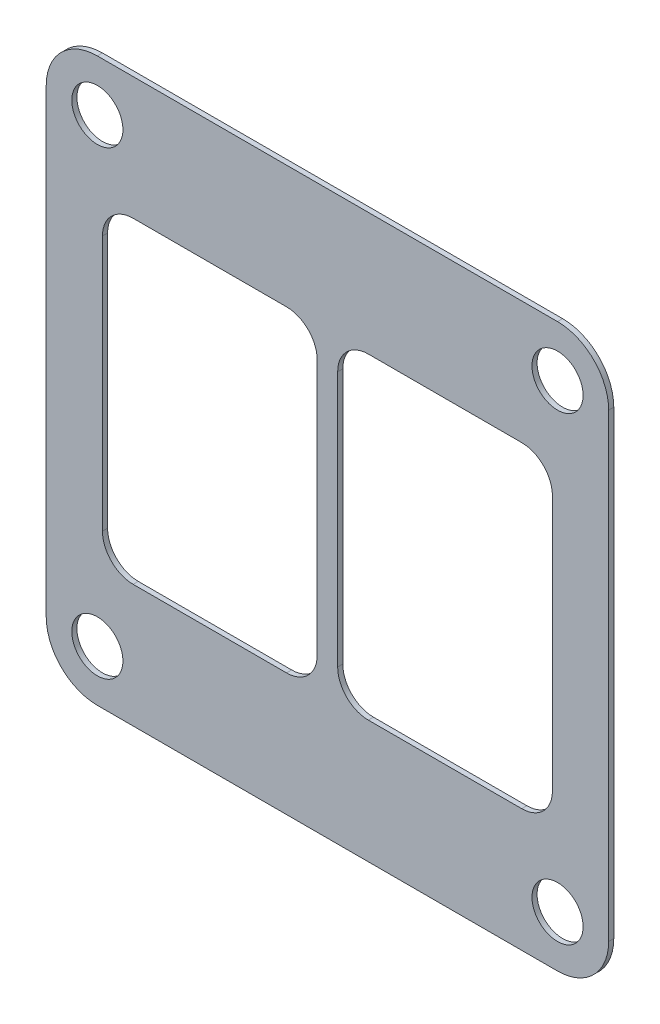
ISO-10303-21;
HEADER;
FILE_DESCRIPTION(('STEP AP214'),'2;1');
FILE_NAME('part.step','',(''),(''),'','','');
FILE_SCHEMA(('AUTOMOTIVE_DESIGN { 1 0 10303 214 1 1 1 1 }'));
ENDSEC;
DATA;
#1=APPLICATION_CONTEXT('core data for automotive mechanical design processes');
#2=APPLICATION_PROTOCOL_DEFINITION('international standard','automotive_design',2000,#1);
#3=PRODUCT_CONTEXT('',#1,'mechanical');
#4=PRODUCT('Part','Part','',(#3));
#5=PRODUCT_RELATED_PRODUCT_CATEGORY('part','',(#4));
#6=PRODUCT_DEFINITION_FORMATION('','',#4);
#7=PRODUCT_DEFINITION_CONTEXT('part definition',#1,'design');
#8=PRODUCT_DEFINITION('design','',#6,#7);
#9=PRODUCT_DEFINITION_SHAPE('','',#8);
#10=(LENGTH_UNIT() NAMED_UNIT(*) SI_UNIT(.MILLI.,.METRE.));
#11=(NAMED_UNIT(*) PLANE_ANGLE_UNIT() SI_UNIT($,.RADIAN.));
#12=(NAMED_UNIT(*) SI_UNIT($,.STERADIAN.) SOLID_ANGLE_UNIT());
#13=UNCERTAINTY_MEASURE_WITH_UNIT(LENGTH_MEASURE(1.E-05),#10,'distance_accuracy_value','');
#14=(GEOMETRIC_REPRESENTATION_CONTEXT(3) GLOBAL_UNCERTAINTY_ASSIGNED_CONTEXT((#13)) GLOBAL_UNIT_ASSIGNED_CONTEXT((#10,
#11,#12)) REPRESENTATION_CONTEXT('',''));
#15=CARTESIAN_POINT('',(0.,0.,0.));
#16=DIRECTION('',(0.,0.,1.));
#17=DIRECTION('',(1.,0.,0.));
#18=AXIS2_PLACEMENT_3D('',#15,#16,#17);
#19=CARTESIAN_POINT('',(-27.5,-27.5,0.5));
#20=DIRECTION('',(0.,0.,1.));
#21=DIRECTION('',(1.,0.,0.));
#22=AXIS2_PLACEMENT_3D('',#19,#20,#21);
#23=PLANE('',#22);
#24=DIRECTION('',(-1.,0.,0.));
#25=VECTOR('',#24,1.);
#26=CARTESIAN_POINT('',(-27.5,27.5,0.5));
#27=LINE('',#26,#25);
#28=CARTESIAN_POINT('',(22.5,27.5,0.5));
#29=VERTEX_POINT('',#28);
#30=CARTESIAN_POINT('',(-22.5,27.5,0.5));
#31=VERTEX_POINT('',#30);
#32=EDGE_CURVE('E239',#29,#31,#27,.T.);
#33=ORIENTED_EDGE('',*,*,#32,.T.);
#34=CARTESIAN_POINT('',(-22.5,22.5,0.5));
#35=DIRECTION('',(0.,0.,1.));
#36=DIRECTION('',(1.,0.,0.));
#37=AXIS2_PLACEMENT_3D('',#34,#35,#36);
#38=CIRCLE('',#37,5.);
#39=CARTESIAN_POINT('',(-27.5,22.5,0.5));
#40=VERTEX_POINT('',#39);
#41=EDGE_CURVE('E256',#31,#40,#38,.T.);
#42=ORIENTED_EDGE('',*,*,#41,.T.);
#43=DIRECTION('',(0.,-1.,0.));
#44=VECTOR('',#43,1.);
#45=CARTESIAN_POINT('',(-27.5,27.5,0.5));
#46=LINE('',#45,#44);
#47=CARTESIAN_POINT('',(-27.5,-22.5,0.5));
#48=VERTEX_POINT('',#47);
#49=EDGE_CURVE('E210',#40,#48,#46,.T.);
#50=ORIENTED_EDGE('',*,*,#49,.T.);
#51=CARTESIAN_POINT('',(-22.5,-22.5,0.5));
#52=DIRECTION('',(0.,0.,1.));
#53=DIRECTION('',(1.,0.,0.));
#54=AXIS2_PLACEMENT_3D('',#51,#52,#53);
#55=CIRCLE('',#54,5.);
#56=CARTESIAN_POINT('',(-22.5,-27.5,0.5));
#57=VERTEX_POINT('',#56);
#58=EDGE_CURVE('E250',#48,#57,#55,.T.);
#59=ORIENTED_EDGE('',*,*,#58,.T.);
#60=DIRECTION('',(1.,0.,0.));
#61=VECTOR('',#60,1.);
#62=CARTESIAN_POINT('',(-27.5,-27.5,0.5));
#63=LINE('',#62,#61);
#64=CARTESIAN_POINT('',(22.5,-27.5,0.5));
#65=VERTEX_POINT('',#64);
#66=EDGE_CURVE('E233',#57,#65,#63,.T.);
#67=ORIENTED_EDGE('',*,*,#66,.T.);
#68=CARTESIAN_POINT('',(22.5,-22.5,0.5));
#69=DIRECTION('',(0.,0.,1.));
#70=DIRECTION('',(1.,0.,0.));
#71=AXIS2_PLACEMENT_3D('',#68,#69,#70);
#72=CIRCLE('',#71,5.);
#73=CARTESIAN_POINT('',(27.5,-22.5,0.5));
#74=VERTEX_POINT('',#73);
#75=EDGE_CURVE('E252',#65,#74,#72,.T.);
#76=ORIENTED_EDGE('',*,*,#75,.T.);
#77=DIRECTION('',(0.,1.,0.));
#78=VECTOR('',#77,1.);
#79=CARTESIAN_POINT('',(27.5,27.5,0.5));
#80=LINE('',#79,#78);
#81=CARTESIAN_POINT('',(27.5,22.5,0.5));
#82=VERTEX_POINT('',#81);
#83=EDGE_CURVE('E236',#74,#82,#80,.T.);
#84=ORIENTED_EDGE('',*,*,#83,.T.);
#85=CARTESIAN_POINT('',(22.5,22.5,0.5));
#86=DIRECTION('',(0.,0.,1.));
#87=DIRECTION('',(1.,0.,0.));
#88=AXIS2_PLACEMENT_3D('',#85,#86,#87);
#89=CIRCLE('',#88,5.);
#90=EDGE_CURVE('E254',#82,#29,#89,.T.);
#91=ORIENTED_EDGE('',*,*,#90,.T.);
#92=EDGE_LOOP('',(#33,#42,#50,#59,#67,#76,#84,#91));
#93=FACE_BOUND('',#92,.T.);
#94=CARTESIAN_POINT('',(-22.5,22.5,0.5));
#95=DIRECTION('',(0.,0.,1.));
#96=DIRECTION('',(1.,0.,0.));
#97=AXIS2_PLACEMENT_3D('',#94,#95,#96);
#98=CIRCLE('',#97,2.5);
#99=CARTESIAN_POINT('',(-20.,22.5,0.5));
#100=VERTEX_POINT('',#99);
#101=EDGE_CURVE('E224',#100,#100,#98,.T.);
#102=ORIENTED_EDGE('',*,*,#101,.F.);
#103=EDGE_LOOP('',(#102));
#104=FACE_BOUND('',#103,.T.);
#105=CARTESIAN_POINT('',(22.5,22.5,0.5));
#106=DIRECTION('',(0.,0.,1.));
#107=DIRECTION('',(-1.,0.,0.));
#108=AXIS2_PLACEMENT_3D('',#105,#106,#107);
#109=CIRCLE('',#108,2.5);
#110=CARTESIAN_POINT('',(20.,22.5,0.5));
#111=VERTEX_POINT('',#110);
#112=EDGE_CURVE('E402',#111,#111,#109,.T.);
#113=ORIENTED_EDGE('',*,*,#112,.F.);
#114=EDGE_LOOP('',(#113));
#115=FACE_BOUND('',#114,.T.);
#116=CARTESIAN_POINT('',(22.5,-22.5,0.5));
#117=DIRECTION('',(0.,0.,1.));
#118=DIRECTION('',(1.,0.,0.));
#119=AXIS2_PLACEMENT_3D('',#116,#117,#118);
#120=CIRCLE('',#119,2.5);
#121=CARTESIAN_POINT('',(25.,-22.5,0.5));
#122=VERTEX_POINT('',#121);
#123=EDGE_CURVE('E396',#122,#122,#120,.T.);
#124=ORIENTED_EDGE('',*,*,#123,.F.);
#125=EDGE_LOOP('',(#124));
#126=FACE_BOUND('',#125,.T.);
#127=CARTESIAN_POINT('',(-22.5,-22.5,0.5));
#128=DIRECTION('',(0.,0.,1.));
#129=DIRECTION('',(-1.,0.,0.));
#130=AXIS2_PLACEMENT_3D('',#127,#128,#129);
#131=CIRCLE('',#130,2.5);
#132=CARTESIAN_POINT('',(-25.,-22.5,0.5));
#133=VERTEX_POINT('',#132);
#134=EDGE_CURVE('E390',#133,#133,#131,.T.);
#135=ORIENTED_EDGE('',*,*,#134,.F.);
#136=EDGE_LOOP('',(#135));
#137=FACE_BOUND('',#136,.T.);
#138=DIRECTION('',(0.,-1.,0.));
#139=VECTOR('',#138,1.);
#140=CARTESIAN_POINT('',(0.999999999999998,15.5,0.5));
#141=LINE('',#140,#139);
#142=CARTESIAN_POINT('',(0.999999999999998,12.5,0.5));
#143=VERTEX_POINT('',#142);
#144=CARTESIAN_POINT('',(1.,-12.5,0.5));
#145=VERTEX_POINT('',#144);
#146=EDGE_CURVE('E366',#143,#145,#141,.T.);
#147=ORIENTED_EDGE('',*,*,#146,.F.);
#148=CARTESIAN_POINT('',(4.,12.5,0.5));
#149=DIRECTION('',(0.,0.,1.));
#150=DIRECTION('',(1.,0.,0.));
#151=AXIS2_PLACEMENT_3D('',#148,#149,#150);
#152=CIRCLE('',#151,3.);
#153=CARTESIAN_POINT('',(4.,15.5,0.5));
#154=VERTEX_POINT('',#153);
#155=EDGE_CURVE('E288',#143,#154,#152,.F.);
#156=ORIENTED_EDGE('',*,*,#155,.T.);
#157=DIRECTION('',(-1.,0.,0.));
#158=VECTOR('',#157,1.);
#159=CARTESIAN_POINT('',(0.999999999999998,15.5,0.5));
#160=LINE('',#159,#158);
#161=CARTESIAN_POINT('',(19.,15.5,0.5));
#162=VERTEX_POINT('',#161);
#163=EDGE_CURVE('E375',#162,#154,#160,.T.);
#164=ORIENTED_EDGE('',*,*,#163,.F.);
#165=CARTESIAN_POINT('',(19.,12.5,0.5));
#166=DIRECTION('',(0.,0.,1.));
#167=DIRECTION('',(1.,0.,0.));
#168=AXIS2_PLACEMENT_3D('',#165,#166,#167);
#169=CIRCLE('',#168,3.);
#170=CARTESIAN_POINT('',(22.,12.5,0.5));
#171=VERTEX_POINT('',#170);
#172=EDGE_CURVE('E292',#162,#171,#169,.F.);
#173=ORIENTED_EDGE('',*,*,#172,.T.);
#174=DIRECTION('',(0.,1.,0.));
#175=VECTOR('',#174,1.);
#176=CARTESIAN_POINT('',(22.,15.5,0.5));
#177=LINE('',#176,#175);
#178=CARTESIAN_POINT('',(22.,-12.5,0.5));
#179=VERTEX_POINT('',#178);
#180=EDGE_CURVE('E372',#179,#171,#177,.T.);
#181=ORIENTED_EDGE('',*,*,#180,.F.);
#182=CARTESIAN_POINT('',(19.,-12.5,0.5));
#183=DIRECTION('',(0.,0.,1.));
#184=DIRECTION('',(1.,0.,0.));
#185=AXIS2_PLACEMENT_3D('',#182,#183,#184);
#186=CIRCLE('',#185,3.);
#187=CARTESIAN_POINT('',(19.,-15.5,0.5));
#188=VERTEX_POINT('',#187);
#189=EDGE_CURVE('E296',#179,#188,#186,.F.);
#190=ORIENTED_EDGE('',*,*,#189,.T.);
#191=DIRECTION('',(1.,0.,0.));
#192=VECTOR('',#191,1.);
#193=CARTESIAN_POINT('',(1.,-15.5,0.5));
#194=LINE('',#193,#192);
#195=CARTESIAN_POINT('',(4.,-15.5,0.5));
#196=VERTEX_POINT('',#195);
#197=EDGE_CURVE('E369',#196,#188,#194,.T.);
#198=ORIENTED_EDGE('',*,*,#197,.F.);
#199=CARTESIAN_POINT('',(4.,-12.5,0.5));
#200=DIRECTION('',(0.,0.,1.));
#201=DIRECTION('',(1.,0.,0.));
#202=AXIS2_PLACEMENT_3D('',#199,#200,#201);
#203=CIRCLE('',#202,3.);
#204=EDGE_CURVE('E300',#196,#145,#203,.F.);
#205=ORIENTED_EDGE('',*,*,#204,.T.);
#206=EDGE_LOOP('',(#147,#156,#164,#173,#181,#190,#198,#205));
#207=FACE_BOUND('',#206,.T.);
#208=DIRECTION('',(0.,1.,0.));
#209=VECTOR('',#208,1.);
#210=CARTESIAN_POINT('',(-22.,15.5,0.5));
#211=LINE('',#210,#209);
#212=CARTESIAN_POINT('',(-22.,-12.5,0.5));
#213=VERTEX_POINT('',#212);
#214=CARTESIAN_POINT('',(-22.,12.5,0.5));
#215=VERTEX_POINT('',#214);
#216=EDGE_CURVE('E345',#213,#215,#211,.T.);
#217=ORIENTED_EDGE('',*,*,#216,.T.);
#218=CARTESIAN_POINT('',(-19.,12.5,0.5));
#219=DIRECTION('',(0.,0.,1.));
#220=DIRECTION('',(1.,0.,0.));
#221=AXIS2_PLACEMENT_3D('',#218,#219,#220);
#222=CIRCLE('',#221,3.);
#223=CARTESIAN_POINT('',(-19.,15.5,0.5));
#224=VERTEX_POINT('',#223);
#225=EDGE_CURVE('E327',#215,#224,#222,.F.);
#226=ORIENTED_EDGE('',*,*,#225,.T.);
#227=DIRECTION('',(1.,0.,0.));
#228=VECTOR('',#227,1.);
#229=CARTESIAN_POINT('',(-0.999999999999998,15.5,0.5));
#230=LINE('',#229,#228);
#231=CARTESIAN_POINT('',(-4.,15.5,0.5));
#232=VERTEX_POINT('',#231);
#233=EDGE_CURVE('E737',#224,#232,#230,.T.);
#234=ORIENTED_EDGE('',*,*,#233,.T.);
#235=CARTESIAN_POINT('',(-4.,12.5,0.5));
#236=DIRECTION('',(0.,0.,1.));
#237=DIRECTION('',(1.,0.,0.));
#238=AXIS2_PLACEMENT_3D('',#235,#236,#237);
#239=CIRCLE('',#238,3.);
#240=CARTESIAN_POINT('',(-0.999999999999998,12.5,0.5));
#241=VERTEX_POINT('',#240);
#242=EDGE_CURVE('E323',#232,#241,#239,.F.);
#243=ORIENTED_EDGE('',*,*,#242,.T.);
#244=DIRECTION('',(0.,-1.,0.));
#245=VECTOR('',#244,1.);
#246=CARTESIAN_POINT('',(-0.999999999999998,15.5,0.5));
#247=LINE('',#246,#245);
#248=CARTESIAN_POINT('',(-1.,-12.5,0.5));
#249=VERTEX_POINT('',#248);
#250=EDGE_CURVE('E339',#241,#249,#247,.T.);
#251=ORIENTED_EDGE('',*,*,#250,.T.);
#252=CARTESIAN_POINT('',(-4.,-12.5,0.5));
#253=DIRECTION('',(0.,0.,1.));
#254=DIRECTION('',(1.,0.,0.));
#255=AXIS2_PLACEMENT_3D('',#252,#253,#254);
#256=CIRCLE('',#255,3.);
#257=CARTESIAN_POINT('',(-4.,-15.5,0.5));
#258=VERTEX_POINT('',#257);
#259=EDGE_CURVE('E37',#249,#258,#256,.F.);
#260=ORIENTED_EDGE('',*,*,#259,.T.);
#261=DIRECTION('',(-1.,0.,0.));
#262=VECTOR('',#261,1.);
#263=CARTESIAN_POINT('',(-1.,-15.5,0.5));
#264=LINE('',#263,#262);
#265=CARTESIAN_POINT('',(-19.,-15.5,0.5));
#266=VERTEX_POINT('',#265);
#267=EDGE_CURVE('E337',#258,#266,#264,.T.);
#268=ORIENTED_EDGE('',*,*,#267,.T.);
#269=CARTESIAN_POINT('',(-19.,-12.5,0.5));
#270=DIRECTION('',(0.,0.,1.));
#271=DIRECTION('',(1.,0.,0.));
#272=AXIS2_PLACEMENT_3D('',#269,#270,#271);
#273=CIRCLE('',#272,3.);
#274=EDGE_CURVE('E331',#266,#213,#273,.F.);
#275=ORIENTED_EDGE('',*,*,#274,.T.);
#276=EDGE_LOOP('',(#217,#226,#234,#243,#251,#260,#268,#275));
#277=FACE_BOUND('',#276,.T.);
#278=ADVANCED_FACE('F29',(#93,#104,#115,#126,#137,#207,#277),#23,.T.);
#279=CARTESIAN_POINT('',(-27.5,-27.5,0.));
#280=DIRECTION('',(0.,0.,1.));
#281=DIRECTION('',(1.,0.,0.));
#282=AXIS2_PLACEMENT_3D('',#279,#280,#281);
#283=PLANE('',#282);
#284=DIRECTION('',(0.,-1.,0.));
#285=VECTOR('',#284,1.);
#286=CARTESIAN_POINT('',(-27.5,27.5,0.));
#287=LINE('',#286,#285);
#288=CARTESIAN_POINT('',(-27.5,22.5,0.));
#289=VERTEX_POINT('',#288);
#290=CARTESIAN_POINT('',(-27.5,-22.5,0.));
#291=VERTEX_POINT('',#290);
#292=EDGE_CURVE('E207',#289,#291,#287,.T.);
#293=ORIENTED_EDGE('',*,*,#292,.F.);
#294=CARTESIAN_POINT('',(-22.5,22.5,0.));
#295=DIRECTION('',(0.,0.,1.));
#296=DIRECTION('',(1.,0.,0.));
#297=AXIS2_PLACEMENT_3D('',#294,#295,#296);
#298=CIRCLE('',#297,5.);
#299=CARTESIAN_POINT('',(-22.5,27.5,0.));
#300=VERTEX_POINT('',#299);
#301=EDGE_CURVE('E191',#289,#300,#298,.F.);
#302=ORIENTED_EDGE('',*,*,#301,.T.);
#303=DIRECTION('',(-1.,0.,0.));
#304=VECTOR('',#303,1.);
#305=CARTESIAN_POINT('',(-27.5,27.5,0.));
#306=LINE('',#305,#304);
#307=CARTESIAN_POINT('',(22.5,27.5,0.));
#308=VERTEX_POINT('',#307);
#309=EDGE_CURVE('E230',#308,#300,#306,.T.);
#310=ORIENTED_EDGE('',*,*,#309,.F.);
#311=CARTESIAN_POINT('',(22.5,22.5,0.));
#312=DIRECTION('',(0.,0.,1.));
#313=DIRECTION('',(1.,0.,0.));
#314=AXIS2_PLACEMENT_3D('',#311,#312,#313);
#315=CIRCLE('',#314,5.);
#316=CARTESIAN_POINT('',(27.5,22.5,0.));
#317=VERTEX_POINT('',#316);
#318=EDGE_CURVE('E202',#308,#317,#315,.F.);
#319=ORIENTED_EDGE('',*,*,#318,.T.);
#320=DIRECTION('',(0.,1.,0.));
#321=VECTOR('',#320,1.);
#322=CARTESIAN_POINT('',(27.5,27.5,0.));
#323=LINE('',#322,#321);
#324=CARTESIAN_POINT('',(27.5,-22.5,0.));
#325=VERTEX_POINT('',#324);
#326=EDGE_CURVE('E221',#325,#317,#323,.T.);
#327=ORIENTED_EDGE('',*,*,#326,.F.);
#328=CARTESIAN_POINT('',(22.5,-22.5,0.));
#329=DIRECTION('',(0.,0.,1.));
#330=DIRECTION('',(1.,0.,0.));
#331=AXIS2_PLACEMENT_3D('',#328,#329,#330);
#332=CIRCLE('',#331,5.);
#333=CARTESIAN_POINT('',(22.5,-27.5,0.));
#334=VERTEX_POINT('',#333);
#335=EDGE_CURVE('E244',#325,#334,#332,.F.);
#336=ORIENTED_EDGE('',*,*,#335,.T.);
#337=DIRECTION('',(1.,0.,0.));
#338=VECTOR('',#337,1.);
#339=CARTESIAN_POINT('',(-27.5,-27.5,0.));
#340=LINE('',#339,#338);
#341=CARTESIAN_POINT('',(-22.5,-27.5,0.));
#342=VERTEX_POINT('',#341);
#343=EDGE_CURVE('E217',#342,#334,#340,.T.);
#344=ORIENTED_EDGE('',*,*,#343,.F.);
#345=CARTESIAN_POINT('',(-22.5,-22.5,0.));
#346=DIRECTION('',(0.,0.,1.));
#347=DIRECTION('',(1.,0.,0.));
#348=AXIS2_PLACEMENT_3D('',#345,#346,#347);
#349=CIRCLE('',#348,5.);
#350=EDGE_CURVE('E211',#342,#291,#349,.F.);
#351=ORIENTED_EDGE('',*,*,#350,.T.);
#352=EDGE_LOOP('',(#293,#302,#310,#319,#327,#336,#344,#351));
#353=FACE_BOUND('',#352,.T.);
#354=CARTESIAN_POINT('',(-22.5,22.5,0.));
#355=DIRECTION('',(0.,0.,1.));
#356=DIRECTION('',(1.,0.,0.));
#357=AXIS2_PLACEMENT_3D('',#354,#355,#356);
#358=CIRCLE('',#357,2.5);
#359=CARTESIAN_POINT('',(-20.,22.5,0.));
#360=VERTEX_POINT('',#359);
#361=EDGE_CURVE('E218',#360,#360,#358,.T.);
#362=ORIENTED_EDGE('',*,*,#361,.T.);
#363=EDGE_LOOP('',(#362));
#364=FACE_BOUND('',#363,.T.);
#365=CARTESIAN_POINT('',(22.5,22.5,0.));
#366=DIRECTION('',(0.,0.,1.));
#367=DIRECTION('',(-1.,0.,0.));
#368=AXIS2_PLACEMENT_3D('',#365,#366,#367);
#369=CIRCLE('',#368,2.5);
#370=CARTESIAN_POINT('',(20.,22.5,0.));
#371=VERTEX_POINT('',#370);
#372=EDGE_CURVE('E405',#371,#371,#369,.T.);
#373=ORIENTED_EDGE('',*,*,#372,.T.);
#374=EDGE_LOOP('',(#373));
#375=FACE_BOUND('',#374,.T.);
#376=CARTESIAN_POINT('',(22.5,-22.5,0.));
#377=DIRECTION('',(0.,0.,1.));
#378=DIRECTION('',(1.,0.,0.));
#379=AXIS2_PLACEMENT_3D('',#376,#377,#378);
#380=CIRCLE('',#379,2.5);
#381=CARTESIAN_POINT('',(25.,-22.5,0.));
#382=VERTEX_POINT('',#381);
#383=EDGE_CURVE('E399',#382,#382,#380,.T.);
#384=ORIENTED_EDGE('',*,*,#383,.T.);
#385=EDGE_LOOP('',(#384));
#386=FACE_BOUND('',#385,.T.);
#387=CARTESIAN_POINT('',(-22.5,-22.5,0.));
#388=DIRECTION('',(0.,0.,1.));
#389=DIRECTION('',(-1.,0.,0.));
#390=AXIS2_PLACEMENT_3D('',#387,#388,#389);
#391=CIRCLE('',#390,2.5);
#392=CARTESIAN_POINT('',(-25.,-22.5,0.));
#393=VERTEX_POINT('',#392);
#394=EDGE_CURVE('E393',#393,#393,#391,.T.);
#395=ORIENTED_EDGE('',*,*,#394,.T.);
#396=EDGE_LOOP('',(#395));
#397=FACE_BOUND('',#396,.T.);
#398=DIRECTION('',(0.,1.,0.));
#399=VECTOR('',#398,1.);
#400=CARTESIAN_POINT('',(22.,15.5,0.));
#401=LINE('',#400,#399);
#402=CARTESIAN_POINT('',(22.,-12.5,0.));
#403=VERTEX_POINT('',#402);
#404=CARTESIAN_POINT('',(22.,12.5,0.));
#405=VERTEX_POINT('',#404);
#406=EDGE_CURVE('E384',#403,#405,#401,.T.);
#407=ORIENTED_EDGE('',*,*,#406,.T.);
#408=CARTESIAN_POINT('',(19.,12.5,0.));
#409=DIRECTION('',(0.,0.,1.));
#410=DIRECTION('',(1.,0.,0.));
#411=AXIS2_PLACEMENT_3D('',#408,#409,#410);
#412=CIRCLE('',#411,3.);
#413=CARTESIAN_POINT('',(19.,15.5,0.));
#414=VERTEX_POINT('',#413);
#415=EDGE_CURVE('E294',#405,#414,#412,.T.);
#416=ORIENTED_EDGE('',*,*,#415,.T.);
#417=DIRECTION('',(-1.,0.,0.));
#418=VECTOR('',#417,1.);
#419=CARTESIAN_POINT('',(0.999999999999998,15.5,0.));
#420=LINE('',#419,#418);
#421=CARTESIAN_POINT('',(4.,15.5,0.));
#422=VERTEX_POINT('',#421);
#423=EDGE_CURVE('E387',#414,#422,#420,.T.);
#424=ORIENTED_EDGE('',*,*,#423,.T.);
#425=CARTESIAN_POINT('',(4.,12.5,0.));
#426=DIRECTION('',(0.,0.,1.));
#427=DIRECTION('',(1.,0.,0.));
#428=AXIS2_PLACEMENT_3D('',#425,#426,#427);
#429=CIRCLE('',#428,3.);
#430=CARTESIAN_POINT('',(0.999999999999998,12.5,0.));
#431=VERTEX_POINT('',#430);
#432=EDGE_CURVE('E290',#422,#431,#429,.T.);
#433=ORIENTED_EDGE('',*,*,#432,.T.);
#434=DIRECTION('',(0.,-1.,0.));
#435=VECTOR('',#434,1.);
#436=CARTESIAN_POINT('',(0.999999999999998,15.5,0.));
#437=LINE('',#436,#435);
#438=CARTESIAN_POINT('',(1.,-12.5,0.));
#439=VERTEX_POINT('',#438);
#440=EDGE_CURVE('E378',#431,#439,#437,.T.);
#441=ORIENTED_EDGE('',*,*,#440,.T.);
#442=CARTESIAN_POINT('',(4.,-12.5,0.));
#443=DIRECTION('',(0.,0.,1.));
#444=DIRECTION('',(1.,0.,0.));
#445=AXIS2_PLACEMENT_3D('',#442,#443,#444);
#446=CIRCLE('',#445,3.);
#447=CARTESIAN_POINT('',(4.,-15.5,0.));
#448=VERTEX_POINT('',#447);
#449=EDGE_CURVE('E302',#439,#448,#446,.T.);
#450=ORIENTED_EDGE('',*,*,#449,.T.);
#451=DIRECTION('',(1.,0.,0.));
#452=VECTOR('',#451,1.);
#453=CARTESIAN_POINT('',(1.,-15.5,0.));
#454=LINE('',#453,#452);
#455=CARTESIAN_POINT('',(19.,-15.5,0.));
#456=VERTEX_POINT('',#455);
#457=EDGE_CURVE('E381',#448,#456,#454,.T.);
#458=ORIENTED_EDGE('',*,*,#457,.T.);
#459=CARTESIAN_POINT('',(19.,-12.5,0.));
#460=DIRECTION('',(0.,0.,1.));
#461=DIRECTION('',(1.,0.,0.));
#462=AXIS2_PLACEMENT_3D('',#459,#460,#461);
#463=CIRCLE('',#462,3.);
#464=EDGE_CURVE('E298',#456,#403,#463,.T.);
#465=ORIENTED_EDGE('',*,*,#464,.T.);
#466=EDGE_LOOP('',(#407,#416,#424,#433,#441,#450,#458,#465));
#467=FACE_BOUND('',#466,.T.);
#468=DIRECTION('',(0.,-1.,0.));
#469=VECTOR('',#468,1.);
#470=CARTESIAN_POINT('',(-0.999999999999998,15.5,0.));
#471=LINE('',#470,#469);
#472=CARTESIAN_POINT('',(-0.999999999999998,12.5,0.));
#473=VERTEX_POINT('',#472);
#474=CARTESIAN_POINT('',(-1.,-12.5,0.));
#475=VERTEX_POINT('',#474);
#476=EDGE_CURVE('E344',#473,#475,#471,.T.);
#477=ORIENTED_EDGE('',*,*,#476,.F.);
#478=CARTESIAN_POINT('',(-4.,12.5,0.));
#479=DIRECTION('',(0.,0.,1.));
#480=DIRECTION('',(1.,0.,0.));
#481=AXIS2_PLACEMENT_3D('',#478,#479,#480);
#482=CIRCLE('',#481,3.);
#483=CARTESIAN_POINT('',(-4.,15.5,0.));
#484=VERTEX_POINT('',#483);
#485=EDGE_CURVE('E325',#473,#484,#482,.T.);
#486=ORIENTED_EDGE('',*,*,#485,.T.);
#487=DIRECTION('',(1.,0.,0.));
#488=VECTOR('',#487,1.);
#489=CARTESIAN_POINT('',(-0.999999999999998,15.5,0.));
#490=LINE('',#489,#488);
#491=CARTESIAN_POINT('',(-19.,15.5,0.));
#492=VERTEX_POINT('',#491);
#493=EDGE_CURVE('E356',#492,#484,#490,.T.);
#494=ORIENTED_EDGE('',*,*,#493,.F.);
#495=CARTESIAN_POINT('',(-19.,12.5,0.));
#496=DIRECTION('',(0.,0.,1.));
#497=DIRECTION('',(1.,0.,0.));
#498=AXIS2_PLACEMENT_3D('',#495,#496,#497);
#499=CIRCLE('',#498,3.);
#500=CARTESIAN_POINT('',(-22.,12.5,0.));
#501=VERTEX_POINT('',#500);
#502=EDGE_CURVE('E329',#492,#501,#499,.T.);
#503=ORIENTED_EDGE('',*,*,#502,.T.);
#504=DIRECTION('',(0.,1.,0.));
#505=VECTOR('',#504,1.);
#506=CARTESIAN_POINT('',(-22.,15.5,0.));
#507=LINE('',#506,#505);
#508=CARTESIAN_POINT('',(-22.,-12.5,0.));
#509=VERTEX_POINT('',#508);
#510=EDGE_CURVE('E359',#509,#501,#507,.T.);
#511=ORIENTED_EDGE('',*,*,#510,.F.);
#512=CARTESIAN_POINT('',(-19.,-12.5,0.));
#513=DIRECTION('',(0.,0.,1.));
#514=DIRECTION('',(1.,0.,0.));
#515=AXIS2_PLACEMENT_3D('',#512,#513,#514);
#516=CIRCLE('',#515,3.);
#517=CARTESIAN_POINT('',(-19.,-15.5,0.));
#518=VERTEX_POINT('',#517);
#519=EDGE_CURVE('E44',#509,#518,#516,.T.);
#520=ORIENTED_EDGE('',*,*,#519,.T.);
#521=DIRECTION('',(-1.,0.,0.));
#522=VECTOR('',#521,1.);
#523=CARTESIAN_POINT('',(-1.,-15.5,0.));
#524=LINE('',#523,#522);
#525=CARTESIAN_POINT('',(-4.,-15.5,0.));
#526=VERTEX_POINT('',#525);
#527=EDGE_CURVE('E352',#526,#518,#524,.T.);
#528=ORIENTED_EDGE('',*,*,#527,.F.);
#529=CARTESIAN_POINT('',(-4.,-12.5,0.));
#530=DIRECTION('',(0.,0.,1.));
#531=DIRECTION('',(1.,0.,0.));
#532=AXIS2_PLACEMENT_3D('',#529,#530,#531);
#533=CIRCLE('',#532,3.);
#534=EDGE_CURVE('E11',#526,#475,#533,.T.);
#535=ORIENTED_EDGE('',*,*,#534,.T.);
#536=EDGE_LOOP('',(#477,#486,#494,#503,#511,#520,#528,#535));
#537=FACE_BOUND('',#536,.T.);
#538=ADVANCED_FACE('F214',(#353,#364,#375,#386,#397,#467,#537),#283,.F.);
#539=CARTESIAN_POINT('',(-27.5,27.5,0.5));
#540=DIRECTION('',(1.,0.,0.));
#541=DIRECTION('',(0.,1.,0.));
#542=AXIS2_PLACEMENT_3D('',#539,#540,#541);
#543=PLANE('',#542);
#544=ORIENTED_EDGE('',*,*,#49,.F.);
#545=DIRECTION('',(0.,0.,-1.));
#546=VECTOR('',#545,1.);
#547=CARTESIAN_POINT('',(-27.5,22.5,0.5));
#548=LINE('',#547,#546);
#549=EDGE_CURVE('E195',#40,#289,#548,.T.);
#550=ORIENTED_EDGE('',*,*,#549,.T.);
#551=ORIENTED_EDGE('',*,*,#292,.T.);
#552=DIRECTION('',(0.,0.,-1.));
#553=VECTOR('',#552,1.);
#554=CARTESIAN_POINT('',(-27.5,-22.5,0.5));
#555=LINE('',#554,#553);
#556=EDGE_CURVE('E212',#291,#48,#555,.F.);
#557=ORIENTED_EDGE('',*,*,#556,.T.);
#558=EDGE_LOOP('',(#544,#550,#551,#557));
#559=FACE_BOUND('',#558,.T.);
#560=ADVANCED_FACE('F31',(#559),#543,.F.);
#561=CARTESIAN_POINT('',(-27.5,-27.5,0.5));
#562=DIRECTION('',(0.,1.,0.));
#563=DIRECTION('',(0.,0.,1.));
#564=AXIS2_PLACEMENT_3D('',#561,#562,#563);
#565=PLANE('',#564);
#566=ORIENTED_EDGE('',*,*,#343,.T.);
#567=DIRECTION('',(0.,0.,-1.));
#568=VECTOR('',#567,1.);
#569=CARTESIAN_POINT('',(22.5,-27.5,0.5));
#570=LINE('',#569,#568);
#571=EDGE_CURVE('E266',#334,#65,#570,.F.);
#572=ORIENTED_EDGE('',*,*,#571,.T.);
#573=ORIENTED_EDGE('',*,*,#66,.F.);
#574=DIRECTION('',(0.,0.,-1.));
#575=VECTOR('',#574,1.);
#576=CARTESIAN_POINT('',(-22.5,-27.5,0.5));
#577=LINE('',#576,#575);
#578=EDGE_CURVE('E263',#57,#342,#577,.T.);
#579=ORIENTED_EDGE('',*,*,#578,.T.);
#580=EDGE_LOOP('',(#566,#572,#573,#579));
#581=FACE_BOUND('',#580,.T.);
#582=ADVANCED_FACE('F512',(#581),#565,.F.);
#583=CARTESIAN_POINT('',(27.5,27.5,0.5));
#584=DIRECTION('',(-1.,0.,0.));
#585=DIRECTION('',(0.,-1.,0.));
#586=AXIS2_PLACEMENT_3D('',#583,#584,#585);
#587=PLANE('',#586);
#588=ORIENTED_EDGE('',*,*,#326,.T.);
#589=DIRECTION('',(0.,0.,-1.));
#590=VECTOR('',#589,1.);
#591=CARTESIAN_POINT('',(27.5,22.5,0.5));
#592=LINE('',#591,#590);
#593=EDGE_CURVE('E261',#317,#82,#592,.F.);
#594=ORIENTED_EDGE('',*,*,#593,.T.);
#595=ORIENTED_EDGE('',*,*,#83,.F.);
#596=DIRECTION('',(0.,0.,-1.));
#597=VECTOR('',#596,1.);
#598=CARTESIAN_POINT('',(27.5,-22.5,0.5));
#599=LINE('',#598,#597);
#600=EDGE_CURVE('E258',#74,#325,#599,.T.);
#601=ORIENTED_EDGE('',*,*,#600,.T.);
#602=EDGE_LOOP('',(#588,#594,#595,#601));
#603=FACE_BOUND('',#602,.T.);
#604=ADVANCED_FACE('F509',(#603),#587,.F.);
#605=CARTESIAN_POINT('',(-27.5,27.5,0.5));
#606=DIRECTION('',(0.,-1.,0.));
#607=DIRECTION('',(0.,0.,-1.));
#608=AXIS2_PLACEMENT_3D('',#605,#606,#607);
#609=PLANE('',#608);
#610=ORIENTED_EDGE('',*,*,#309,.T.);
#611=DIRECTION('',(0.,0.,-1.));
#612=VECTOR('',#611,1.);
#613=CARTESIAN_POINT('',(-22.5,27.5,0.5));
#614=LINE('',#613,#612);
#615=EDGE_CURVE('E196',#300,#31,#614,.F.);
#616=ORIENTED_EDGE('',*,*,#615,.T.);
#617=ORIENTED_EDGE('',*,*,#32,.F.);
#618=DIRECTION('',(0.,0.,-1.));
#619=VECTOR('',#618,1.);
#620=CARTESIAN_POINT('',(22.5,27.5,0.5));
#621=LINE('',#620,#619);
#622=EDGE_CURVE('E201',#29,#308,#621,.T.);
#623=ORIENTED_EDGE('',*,*,#622,.T.);
#624=EDGE_LOOP('',(#610,#616,#617,#623));
#625=FACE_BOUND('',#624,.T.);
#626=ADVANCED_FACE('F504',(#625),#609,.F.);
#627=CARTESIAN_POINT('',(-22.5,22.5,0.5));
#628=DIRECTION('',(0.,0.,-1.));
#629=DIRECTION('',(-1.,0.,0.));
#630=AXIS2_PLACEMENT_3D('',#627,#628,#629);
#631=CYLINDRICAL_SURFACE('',#630,5.);
#632=ORIENTED_EDGE('',*,*,#41,.F.);
#633=ORIENTED_EDGE('',*,*,#615,.F.);
#634=ORIENTED_EDGE('',*,*,#301,.F.);
#635=ORIENTED_EDGE('',*,*,#549,.F.);
#636=EDGE_LOOP('',(#632,#633,#634,#635));
#637=FACE_BOUND('',#636,.T.);
#638=ADVANCED_FACE('F194',(#637),#631,.T.);
#639=CARTESIAN_POINT('',(22.5,22.5,0.5));
#640=DIRECTION('',(0.,0.,-1.));
#641=DIRECTION('',(-1.,0.,0.));
#642=AXIS2_PLACEMENT_3D('',#639,#640,#641);
#643=CYLINDRICAL_SURFACE('',#642,5.);
#644=ORIENTED_EDGE('',*,*,#90,.F.);
#645=ORIENTED_EDGE('',*,*,#593,.F.);
#646=ORIENTED_EDGE('',*,*,#318,.F.);
#647=ORIENTED_EDGE('',*,*,#622,.F.);
#648=EDGE_LOOP('',(#644,#645,#646,#647));
#649=FACE_BOUND('',#648,.T.);
#650=ADVANCED_FACE('F497',(#649),#643,.T.);
#651=CARTESIAN_POINT('',(22.5,-22.5,0.5));
#652=DIRECTION('',(0.,0.,-1.));
#653=DIRECTION('',(-1.,0.,0.));
#654=AXIS2_PLACEMENT_3D('',#651,#652,#653);
#655=CYLINDRICAL_SURFACE('',#654,5.);
#656=ORIENTED_EDGE('',*,*,#75,.F.);
#657=ORIENTED_EDGE('',*,*,#571,.F.);
#658=ORIENTED_EDGE('',*,*,#335,.F.);
#659=ORIENTED_EDGE('',*,*,#600,.F.);
#660=EDGE_LOOP('',(#656,#657,#658,#659));
#661=FACE_BOUND('',#660,.T.);
#662=ADVANCED_FACE('F493',(#661),#655,.T.);
#663=CARTESIAN_POINT('',(-22.5,-22.5,0.5));
#664=DIRECTION('',(0.,0.,-1.));
#665=DIRECTION('',(-1.,0.,0.));
#666=AXIS2_PLACEMENT_3D('',#663,#664,#665);
#667=CYLINDRICAL_SURFACE('',#666,5.);
#668=ORIENTED_EDGE('',*,*,#58,.F.);
#669=ORIENTED_EDGE('',*,*,#556,.F.);
#670=ORIENTED_EDGE('',*,*,#350,.F.);
#671=ORIENTED_EDGE('',*,*,#578,.F.);
#672=EDGE_LOOP('',(#668,#669,#670,#671));
#673=FACE_BOUND('',#672,.T.);
#674=ADVANCED_FACE('F489',(#673),#667,.T.);
#675=CARTESIAN_POINT('',(-22.5,22.5,0.));
#676=DIRECTION('',(0.,0.,1.));
#677=DIRECTION('',(1.,0.,0.));
#678=AXIS2_PLACEMENT_3D('',#675,#676,#677);
#679=CYLINDRICAL_SURFACE('',#678,2.5);
#680=ORIENTED_EDGE('',*,*,#361,.F.);
#681=EDGE_LOOP('',(#680));
#682=FACE_BOUND('',#681,.T.);
#683=ORIENTED_EDGE('',*,*,#101,.T.);
#684=EDGE_LOOP('',(#683));
#685=FACE_BOUND('',#684,.T.);
#686=ADVANCED_FACE('F410',(#682,#685),#679,.F.);
#687=CARTESIAN_POINT('',(22.5,22.5,0.));
#688=DIRECTION('',(0.,0.,1.));
#689=DIRECTION('',(1.,0.,0.));
#690=AXIS2_PLACEMENT_3D('',#687,#688,#689);
#691=CYLINDRICAL_SURFACE('',#690,2.5);
#692=ORIENTED_EDGE('',*,*,#372,.F.);
#693=EDGE_LOOP('',(#692));
#694=FACE_BOUND('',#693,.T.);
#695=ORIENTED_EDGE('',*,*,#112,.T.);
#696=EDGE_LOOP('',(#695));
#697=FACE_BOUND('',#696,.T.);
#698=ADVANCED_FACE('F482',(#694,#697),#691,.F.);
#699=CARTESIAN_POINT('',(22.5,-22.5,0.));
#700=DIRECTION('',(0.,0.,1.));
#701=DIRECTION('',(1.,0.,0.));
#702=AXIS2_PLACEMENT_3D('',#699,#700,#701);
#703=CYLINDRICAL_SURFACE('',#702,2.5);
#704=ORIENTED_EDGE('',*,*,#383,.F.);
#705=EDGE_LOOP('',(#704));
#706=FACE_BOUND('',#705,.T.);
#707=ORIENTED_EDGE('',*,*,#123,.T.);
#708=EDGE_LOOP('',(#707));
#709=FACE_BOUND('',#708,.T.);
#710=ADVANCED_FACE('F478',(#706,#709),#703,.F.);
#711=CARTESIAN_POINT('',(-22.5,-22.5,0.));
#712=DIRECTION('',(0.,0.,1.));
#713=DIRECTION('',(1.,0.,0.));
#714=AXIS2_PLACEMENT_3D('',#711,#712,#713);
#715=CYLINDRICAL_SURFACE('',#714,2.5);
#716=ORIENTED_EDGE('',*,*,#394,.F.);
#717=EDGE_LOOP('',(#716));
#718=FACE_BOUND('',#717,.T.);
#719=ORIENTED_EDGE('',*,*,#134,.T.);
#720=EDGE_LOOP('',(#719));
#721=FACE_BOUND('',#720,.T.);
#722=ADVANCED_FACE('F475',(#718,#721),#715,.F.);
#723=CARTESIAN_POINT('',(0.999999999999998,15.5,0.));
#724=DIRECTION('',(-1.,0.,0.));
#725=DIRECTION('',(0.,-1.,0.));
#726=AXIS2_PLACEMENT_3D('',#723,#724,#725);
#727=PLANE('',#726);
#728=ORIENTED_EDGE('',*,*,#440,.F.);
#729=DIRECTION('',(0.,0.,1.));
#730=VECTOR('',#729,1.);
#731=CARTESIAN_POINT('',(0.999999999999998,12.5,0.5));
#732=LINE('',#731,#730);
#733=EDGE_CURVE('E270',#431,#143,#732,.T.);
#734=ORIENTED_EDGE('',*,*,#733,.T.);
#735=ORIENTED_EDGE('',*,*,#146,.T.);
#736=DIRECTION('',(0.,0.,1.));
#737=VECTOR('',#736,1.);
#738=CARTESIAN_POINT('',(1.,-12.5,0.));
#739=LINE('',#738,#737);
#740=EDGE_CURVE('E268',#145,#439,#739,.F.);
#741=ORIENTED_EDGE('',*,*,#740,.T.);
#742=EDGE_LOOP('',(#728,#734,#735,#741));
#743=FACE_BOUND('',#742,.T.);
#744=ADVANCED_FACE('F428',(#743),#727,.F.);
#745=CARTESIAN_POINT('',(0.999999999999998,15.5,0.));
#746=DIRECTION('',(0.,1.,0.));
#747=DIRECTION('',(0.,0.,1.));
#748=AXIS2_PLACEMENT_3D('',#745,#746,#747);
#749=PLANE('',#748);
#750=ORIENTED_EDGE('',*,*,#163,.T.);
#751=DIRECTION('',(0.,0.,1.));
#752=VECTOR('',#751,1.);
#753=CARTESIAN_POINT('',(4.,15.5,0.));
#754=LINE('',#753,#752);
#755=EDGE_CURVE('E276',#154,#422,#754,.F.);
#756=ORIENTED_EDGE('',*,*,#755,.T.);
#757=ORIENTED_EDGE('',*,*,#423,.F.);
#758=DIRECTION('',(0.,0.,1.));
#759=VECTOR('',#758,1.);
#760=CARTESIAN_POINT('',(19.,15.5,0.5));
#761=LINE('',#760,#759);
#762=EDGE_CURVE('E273',#414,#162,#761,.T.);
#763=ORIENTED_EDGE('',*,*,#762,.T.);
#764=EDGE_LOOP('',(#750,#756,#757,#763));
#765=FACE_BOUND('',#764,.T.);
#766=ADVANCED_FACE('F455',(#765),#749,.F.);
#767=CARTESIAN_POINT('',(22.,15.5,0.));
#768=DIRECTION('',(1.,0.,0.));
#769=DIRECTION('',(0.,0.,-1.));
#770=AXIS2_PLACEMENT_3D('',#767,#768,#769);
#771=PLANE('',#770);
#772=ORIENTED_EDGE('',*,*,#180,.T.);
#773=DIRECTION('',(0.,0.,1.));
#774=VECTOR('',#773,1.);
#775=CARTESIAN_POINT('',(22.,12.5,0.));
#776=LINE('',#775,#774);
#777=EDGE_CURVE('E281',#171,#405,#776,.F.);
#778=ORIENTED_EDGE('',*,*,#777,.T.);
#779=ORIENTED_EDGE('',*,*,#406,.F.);
#780=DIRECTION('',(0.,0.,1.));
#781=VECTOR('',#780,1.);
#782=CARTESIAN_POINT('',(22.,-12.5,0.5));
#783=LINE('',#782,#781);
#784=EDGE_CURVE('E278',#403,#179,#783,.T.);
#785=ORIENTED_EDGE('',*,*,#784,.T.);
#786=EDGE_LOOP('',(#772,#778,#779,#785));
#787=FACE_BOUND('',#786,.T.);
#788=ADVANCED_FACE('F446',(#787),#771,.F.);
#789=CARTESIAN_POINT('',(1.,-15.5,0.));
#790=DIRECTION('',(0.,-1.,0.));
#791=DIRECTION('',(1.,0.,0.));
#792=AXIS2_PLACEMENT_3D('',#789,#790,#791);
#793=PLANE('',#792);
#794=ORIENTED_EDGE('',*,*,#197,.T.);
#795=DIRECTION('',(0.,0.,1.));
#796=VECTOR('',#795,1.);
#797=CARTESIAN_POINT('',(19.,-15.5,0.));
#798=LINE('',#797,#796);
#799=EDGE_CURVE('E286',#188,#456,#798,.F.);
#800=ORIENTED_EDGE('',*,*,#799,.T.);
#801=ORIENTED_EDGE('',*,*,#457,.F.);
#802=DIRECTION('',(0.,0.,1.));
#803=VECTOR('',#802,1.);
#804=CARTESIAN_POINT('',(4.,-15.5,0.5));
#805=LINE('',#804,#803);
#806=EDGE_CURVE('E283',#448,#196,#805,.T.);
#807=ORIENTED_EDGE('',*,*,#806,.T.);
#808=EDGE_LOOP('',(#794,#800,#801,#807));
#809=FACE_BOUND('',#808,.T.);
#810=ADVANCED_FACE('F438',(#809),#793,.F.);
#811=CARTESIAN_POINT('',(4.,12.5,0.));
#812=DIRECTION('',(0.,0.,-1.));
#813=DIRECTION('',(-1.,0.,0.));
#814=AXIS2_PLACEMENT_3D('',#811,#812,#813);
#815=CYLINDRICAL_SURFACE('',#814,3.);
#816=ORIENTED_EDGE('',*,*,#432,.F.);
#817=ORIENTED_EDGE('',*,*,#755,.F.);
#818=ORIENTED_EDGE('',*,*,#155,.F.);
#819=ORIENTED_EDGE('',*,*,#733,.F.);
#820=EDGE_LOOP('',(#816,#817,#818,#819));
#821=FACE_BOUND('',#820,.T.);
#822=ADVANCED_FACE('F458',(#821),#815,.F.);
#823=CARTESIAN_POINT('',(19.,12.5,0.));
#824=DIRECTION('',(0.,0.,-1.));
#825=DIRECTION('',(-1.,0.,0.));
#826=AXIS2_PLACEMENT_3D('',#823,#824,#825);
#827=CYLINDRICAL_SURFACE('',#826,3.);
#828=ORIENTED_EDGE('',*,*,#415,.F.);
#829=ORIENTED_EDGE('',*,*,#777,.F.);
#830=ORIENTED_EDGE('',*,*,#172,.F.);
#831=ORIENTED_EDGE('',*,*,#762,.F.);
#832=EDGE_LOOP('',(#828,#829,#830,#831));
#833=FACE_BOUND('',#832,.T.);
#834=ADVANCED_FACE('F450',(#833),#827,.F.);
#835=CARTESIAN_POINT('',(19.,-12.5,0.));
#836=DIRECTION('',(0.,0.,-1.));
#837=DIRECTION('',(-1.,0.,0.));
#838=AXIS2_PLACEMENT_3D('',#835,#836,#837);
#839=CYLINDRICAL_SURFACE('',#838,3.);
#840=ORIENTED_EDGE('',*,*,#464,.F.);
#841=ORIENTED_EDGE('',*,*,#799,.F.);
#842=ORIENTED_EDGE('',*,*,#189,.F.);
#843=ORIENTED_EDGE('',*,*,#784,.F.);
#844=EDGE_LOOP('',(#840,#841,#842,#843));
#845=FACE_BOUND('',#844,.T.);
#846=ADVANCED_FACE('F441',(#845),#839,.F.);
#847=CARTESIAN_POINT('',(4.,-12.5,0.));
#848=DIRECTION('',(0.,0.,-1.));
#849=DIRECTION('',(-1.,0.,0.));
#850=AXIS2_PLACEMENT_3D('',#847,#848,#849);
#851=CYLINDRICAL_SURFACE('',#850,3.);
#852=ORIENTED_EDGE('',*,*,#449,.F.);
#853=ORIENTED_EDGE('',*,*,#740,.F.);
#854=ORIENTED_EDGE('',*,*,#204,.F.);
#855=ORIENTED_EDGE('',*,*,#806,.F.);
#856=EDGE_LOOP('',(#852,#853,#854,#855));
#857=FACE_BOUND('',#856,.T.);
#858=ADVANCED_FACE('F432',(#857),#851,.F.);
#859=CARTESIAN_POINT('',(-0.999999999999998,15.5,0.));
#860=DIRECTION('',(-1.,0.,0.));
#861=DIRECTION('',(0.,-1.,0.));
#862=AXIS2_PLACEMENT_3D('',#859,#860,#861);
#863=PLANE('',#862);
#864=ORIENTED_EDGE('',*,*,#250,.F.);
#865=DIRECTION('',(0.,0.,1.));
#866=VECTOR('',#865,1.);
#867=CARTESIAN_POINT('',(-0.999999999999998,12.5,0.));
#868=LINE('',#867,#866);
#869=EDGE_CURVE('E312',#241,#473,#868,.F.);
#870=ORIENTED_EDGE('',*,*,#869,.T.);
#871=ORIENTED_EDGE('',*,*,#476,.T.);
#872=DIRECTION('',(0.,0.,1.));
#873=VECTOR('',#872,1.);
#874=CARTESIAN_POINT('',(-1.,-12.5,0.5));
#875=LINE('',#874,#873);
#876=EDGE_CURVE('E309',#475,#249,#875,.T.);
#877=ORIENTED_EDGE('',*,*,#876,.T.);
#878=EDGE_LOOP('',(#864,#870,#871,#877));
#879=FACE_BOUND('',#878,.T.);
#880=ADVANCED_FACE('F354',(#879),#863,.T.);
#881=CARTESIAN_POINT('',(-1.,-15.5,0.));
#882=DIRECTION('',(0.,1.,0.));
#883=DIRECTION('',(-1.,0.,0.));
#884=AXIS2_PLACEMENT_3D('',#881,#882,#883);
#885=PLANE('',#884);
#886=ORIENTED_EDGE('',*,*,#527,.T.);
#887=DIRECTION('',(0.,0.,1.));
#888=VECTOR('',#887,1.);
#889=CARTESIAN_POINT('',(-19.,-15.5,0.5));
#890=LINE('',#889,#888);
#891=EDGE_CURVE('E320',#518,#266,#890,.T.);
#892=ORIENTED_EDGE('',*,*,#891,.T.);
#893=ORIENTED_EDGE('',*,*,#267,.F.);
#894=DIRECTION('',(0.,0.,1.));
#895=VECTOR('',#894,1.);
#896=CARTESIAN_POINT('',(-4.,-15.5,0.));
#897=LINE('',#896,#895);
#898=EDGE_CURVE('E51',#258,#526,#897,.F.);
#899=ORIENTED_EDGE('',*,*,#898,.T.);
#900=EDGE_LOOP('',(#886,#892,#893,#899));
#901=FACE_BOUND('',#900,.T.);
#902=ADVANCED_FACE('F342',(#901),#885,.T.);
#903=CARTESIAN_POINT('',(-22.,15.5,0.));
#904=DIRECTION('',(1.,0.,0.));
#905=DIRECTION('',(0.,0.,-1.));
#906=AXIS2_PLACEMENT_3D('',#903,#904,#905);
#907=PLANE('',#906);
#908=ORIENTED_EDGE('',*,*,#510,.T.);
#909=DIRECTION('',(0.,0.,1.));
#910=VECTOR('',#909,1.);
#911=CARTESIAN_POINT('',(-22.,12.5,0.5));
#912=LINE('',#911,#910);
#913=EDGE_CURVE('E316',#501,#215,#912,.T.);
#914=ORIENTED_EDGE('',*,*,#913,.T.);
#915=ORIENTED_EDGE('',*,*,#216,.F.);
#916=DIRECTION('',(0.,0.,1.));
#917=VECTOR('',#916,1.);
#918=CARTESIAN_POINT('',(-22.,-12.5,0.));
#919=LINE('',#918,#917);
#920=EDGE_CURVE('E314',#213,#509,#919,.F.);
#921=ORIENTED_EDGE('',*,*,#920,.T.);
#922=EDGE_LOOP('',(#908,#914,#915,#921));
#923=FACE_BOUND('',#922,.T.);
#924=ADVANCED_FACE('F669',(#923),#907,.T.);
#925=CARTESIAN_POINT('',(-0.999999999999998,15.5,0.));
#926=DIRECTION('',(0.,-1.,0.));
#927=DIRECTION('',(0.,0.,-1.));
#928=AXIS2_PLACEMENT_3D('',#925,#926,#927);
#929=PLANE('',#928);
#930=ORIENTED_EDGE('',*,*,#493,.T.);
#931=DIRECTION('',(0.,0.,1.));
#932=VECTOR('',#931,1.);
#933=CARTESIAN_POINT('',(-4.,15.5,0.5));
#934=LINE('',#933,#932);
#935=EDGE_CURVE('E306',#484,#232,#934,.T.);
#936=ORIENTED_EDGE('',*,*,#935,.T.);
#937=ORIENTED_EDGE('',*,*,#233,.F.);
#938=DIRECTION('',(0.,0.,1.));
#939=VECTOR('',#938,1.);
#940=CARTESIAN_POINT('',(-19.,15.5,0.));
#941=LINE('',#940,#939);
#942=EDGE_CURVE('E304',#224,#492,#941,.F.);
#943=ORIENTED_EDGE('',*,*,#942,.T.);
#944=EDGE_LOOP('',(#930,#936,#937,#943));
#945=FACE_BOUND('',#944,.T.);
#946=ADVANCED_FACE('F665',(#945),#929,.T.);
#947=CARTESIAN_POINT('',(-4.,12.5,0.));
#948=DIRECTION('',(0.,0.,-1.));
#949=DIRECTION('',(-1.,0.,0.));
#950=AXIS2_PLACEMENT_3D('',#947,#948,#949);
#951=CYLINDRICAL_SURFACE('',#950,3.);
#952=ORIENTED_EDGE('',*,*,#485,.F.);
#953=ORIENTED_EDGE('',*,*,#869,.F.);
#954=ORIENTED_EDGE('',*,*,#242,.F.);
#955=ORIENTED_EDGE('',*,*,#935,.F.);
#956=EDGE_LOOP('',(#952,#953,#954,#955));
#957=FACE_BOUND('',#956,.T.);
#958=ADVANCED_FACE('F668',(#957),#951,.F.);
#959=CARTESIAN_POINT('',(-19.,12.5,0.));
#960=DIRECTION('',(0.,0.,-1.));
#961=DIRECTION('',(-1.,0.,0.));
#962=AXIS2_PLACEMENT_3D('',#959,#960,#961);
#963=CYLINDRICAL_SURFACE('',#962,3.);
#964=ORIENTED_EDGE('',*,*,#502,.F.);
#965=ORIENTED_EDGE('',*,*,#942,.F.);
#966=ORIENTED_EDGE('',*,*,#225,.F.);
#967=ORIENTED_EDGE('',*,*,#913,.F.);
#968=EDGE_LOOP('',(#964,#965,#966,#967));
#969=FACE_BOUND('',#968,.T.);
#970=ADVANCED_FACE('F678',(#969),#963,.F.);
#971=CARTESIAN_POINT('',(-19.,-12.5,0.));
#972=DIRECTION('',(0.,0.,-1.));
#973=DIRECTION('',(-1.,0.,0.));
#974=AXIS2_PLACEMENT_3D('',#971,#972,#973);
#975=CYLINDRICAL_SURFACE('',#974,3.);
#976=ORIENTED_EDGE('',*,*,#519,.F.);
#977=ORIENTED_EDGE('',*,*,#920,.F.);
#978=ORIENTED_EDGE('',*,*,#274,.F.);
#979=ORIENTED_EDGE('',*,*,#891,.F.);
#980=EDGE_LOOP('',(#976,#977,#978,#979));
#981=FACE_BOUND('',#980,.T.);
#982=ADVANCED_FACE('F682',(#981),#975,.F.);
#983=CARTESIAN_POINT('',(-4.,-12.5,0.));
#984=DIRECTION('',(0.,0.,-1.));
#985=DIRECTION('',(-1.,0.,0.));
#986=AXIS2_PLACEMENT_3D('',#983,#984,#985);
#987=CYLINDRICAL_SURFACE('',#986,3.);
#988=ORIENTED_EDGE('',*,*,#534,.F.);
#989=ORIENTED_EDGE('',*,*,#898,.F.);
#990=ORIENTED_EDGE('',*,*,#259,.F.);
#991=ORIENTED_EDGE('',*,*,#876,.F.);
#992=EDGE_LOOP('',(#988,#989,#990,#991));
#993=FACE_BOUND('',#992,.T.);
#994=ADVANCED_FACE('F348',(#993),#987,.F.);
#995=CLOSED_SHELL('',(#278,#538,#560,#582,#604,#626,#638,#650,#662,#674,#686,#698,#710,#722,
#744,#766,#788,#810,#822,#834,#846,#858,#880,#902,#924,#946,#958,#970,#982,#994));
#996=MANIFOLD_SOLID_BREP('B2',#995);
#997=ADVANCED_BREP_SHAPE_REPRESENTATION('',(#18,#996),#14);
#998=SHAPE_DEFINITION_REPRESENTATION(#9,#997);
ENDSEC;
END-ISO-10303-21;
